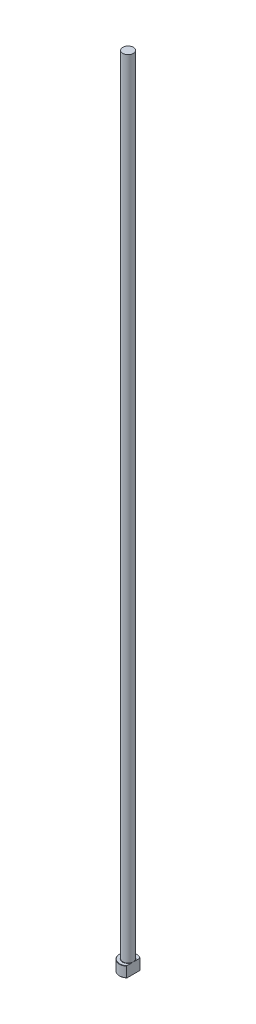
from build123d import *
from build123d.topology import SkipClean

# Parameters (mm, degrees)
CHAMFER1_SIZE    = 0.2
FILLET1_R        = 0.2
KEYED_HEAD_DEPTH = 601.070412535


with BuildPart() as part:
    # Sketch1 → Revolve1 (revolve)
    with BuildSketch(Plane.XY, mode=Mode.PRIVATE) as revolve1_sk:
        Polygon((0, 0), (-6.5, 0), (-6.5, 8), (-4, 8), (-4, 600), (0, 600), align=None)
    revolve(revolve1_sk.sketch.rotate(Axis((0, 259.958771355, 0), (0, -1, 0)), 270), axis=Axis((0, 259.958771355, 0), (0, -1, 0)))

    # Chamfer1
    chamfer1_edges = [part.edges().sort_by_distance(p)[0] for p in [
        (0, 8, -6.5),
        (0, 0, -6.5),
    ]]
    chamfer(chamfer1_edges, length=CHAMFER1_SIZE)

    # Fillet1
    fillet1_edges = [part.edges().sort_by_distance(p)[0] for p in [
        (0, 8, -4),
    ]]
    fillet(fillet1_edges, radius=FILLET1_R)

    # Sketch2 → KEYED HEAD (cut, through all)
    with SkipClean():  # the faces are left unmerged after this step: merging them gives an invalid solid
        with BuildSketch(Plane(origin=(0, 0, 0), x_dir=(1, 0, 0), z_dir=(0, 1, 0))):
            with BuildLine():
                Line((4, -5.123475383), (4, 5.123475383))
                ThreePointArc((4, 5.123475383), (6.5, 0), (4, -5.123475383))
            make_face()
        extrude(amount=KEYED_HEAD_DEPTH, mode=Mode.SUBTRACT)


solid = part.part
